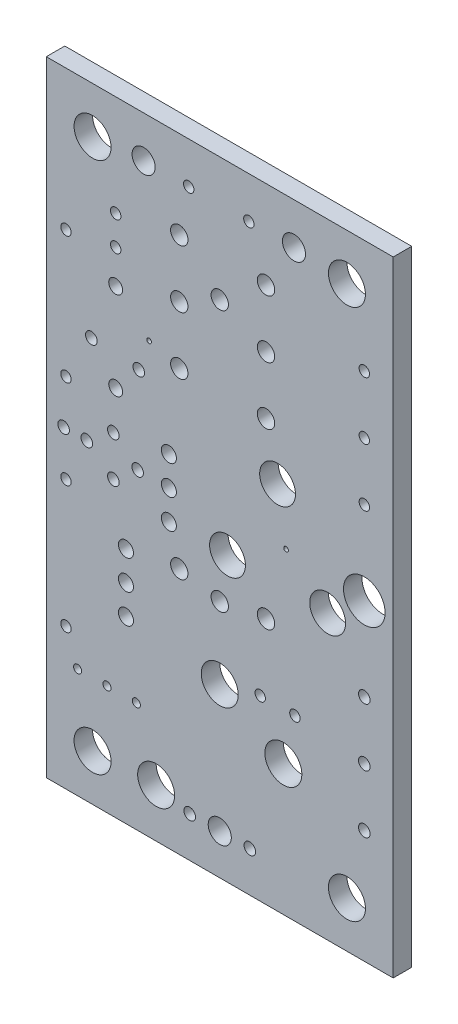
from build123d import *

# Parameters (mm, degrees)
MODEL_W            = 30
MODEL_H            = 54
MODEL_R            = 0.5
MODEL_R_2          = 0.65
MODEL_R_3          = 0.45
MODEL_R_4          = 0.75
MODEL_R_5          = 1.8
MODEL_R_6          = 0.6
MODEL_R_7          = 1.55
MODEL_R_8          = 0.35
MODEL_R_9          = 1
MODEL_R_10         = 1.6
MODEL_R_11         = 0.2
BOSS_EXTRU_1_DEPTH = 1.6


with BuildPart() as part:
    # Model → Boss.-Extru.1 (new body)
    with BuildSketch(Plane.XY):
        with Locations((15, 27)):
            Rectangle(MODEL_W, MODEL_H)
        with Locations((5.79882, 28.75026)):
            Circle(MODEL_R, mode=Mode.SUBTRACT)
        with Locations((6.88975, 18.04924)):
            Circle(MODEL_R_2, mode=Mode.SUBTRACT)
        with Locations((10.60069, 27.0002)):
            Circle(MODEL_R_2, mode=Mode.SUBTRACT)
        with Locations((1.70053, 30.8991)):
            Circle(MODEL_R_3, mode=Mode.SUBTRACT)
        with Locations((19.00047, 41.40074)):
            Circle(MODEL_R_4, mode=Mode.SUBTRACT)
        with Locations((5.79882, 25.25026)):
            Circle(MODEL_R, mode=Mode.SUBTRACT)
        with Locations((7.89882, 27.00026)):
            Circle(MODEL_R, mode=Mode.SUBTRACT)
        with Locations((3.49882, 27.00026)):
            Circle(MODEL_R, mode=Mode.SUBTRACT)
        with Locations((1.49882, 27.00026)):
            Circle(MODEL_R, mode=Mode.SUBTRACT)
        with Locations((10.60069, 29.5402)):
            Circle(MODEL_R_2, mode=Mode.SUBTRACT)
        with Locations((14.99997, 20.69973)):
            Circle(MODEL_R_4, mode=Mode.SUBTRACT)
        with Locations((14.99997, 43.29973)):
            Circle(MODEL_R_4, mode=Mode.SUBTRACT)
        with Locations((19.00047, 46.40074)):
            Circle(MODEL_R_4, mode=Mode.SUBTRACT)
        with Locations((11.50047, 36.40074)):
            Circle(MODEL_R_4, mode=Mode.SUBTRACT)
        with Locations((11.50047, 41.40074)):
            Circle(MODEL_R_4, mode=Mode.SUBTRACT)
        with Locations((11.50047, 46.40074)):
            Circle(MODEL_R_4, mode=Mode.SUBTRACT)
        with Locations((27.49931, 39.20108)):
            Circle(MODEL_R_3, mode=Mode.SUBTRACT)
        with Locations((27.49931, 34.20108)):
            Circle(MODEL_R_3, mode=Mode.SUBTRACT)
        with Locations((27.50058, 27.00058)):
            Circle(MODEL_R_5, mode=Mode.SUBTRACT)
        with Locations((5.99948, 39.80942)):
            Circle(MODEL_R_6, mode=Mode.SUBTRACT)
        with Locations((24.33058, 24.50058)):
            Circle(MODEL_R_7, mode=Mode.SUBTRACT)
        with Locations((27.50058, 19.80058)):
            Circle(MODEL_R, mode=Mode.SUBTRACT)
        with Locations((7.78891, 9.4996)):
            Circle(MODEL_R_8, mode=Mode.SUBTRACT)
        with Locations((2.70891, 9.4996)):
            Circle(MODEL_R_8, mode=Mode.SUBTRACT)
        with Locations((15.67058, 24.50058)):
            Circle(MODEL_R_7, mode=Mode.SUBTRACT)
        with Locations((27.50058, 9.79932)):
            Circle(MODEL_R, mode=Mode.SUBTRACT)
        with Locations((6.88975, 15.50924)):
            Circle(MODEL_R_2, mode=Mode.SUBTRACT)
        with Locations((20.00058, 32.00058)):
            Circle(MODEL_R_7, mode=Mode.SUBTRACT)
        with Locations((12.31711, 50.41646)):
            Circle(MODEL_R_3, mode=Mode.SUBTRACT)
        with Locations((21.41711, 50.41646)):
            Circle(MODEL_R_9, mode=Mode.SUBTRACT)
        with Locations((8.41711, 50.41646)):
            Circle(MODEL_R_9, mode=Mode.SUBTRACT)
        with Locations((1.70053, 12.19962)):
            Circle(MODEL_R_3, mode=Mode.SUBTRACT)
        with Locations((20.49907, 11.303)):
            Circle(MODEL_R_10, mode=Mode.SUBTRACT)
        with Locations((14.9987, 14.50213)):
            Circle(MODEL_R_10, mode=Mode.SUBTRACT)
        with Locations((9.4996, 4.20243)):
            Circle(MODEL_R_10, mode=Mode.SUBTRACT)
        with Locations((6.88975, 20.58924)):
            Circle(MODEL_R_2, mode=Mode.SUBTRACT)
        with Locations((10.60069, 24.4602)):
            Circle(MODEL_R_2, mode=Mode.SUBTRACT)
        with Locations((1.70053, 23.20036)):
            Circle(MODEL_R_3, mode=Mode.SUBTRACT)
        with Locations((27.50058, 14.80058)):
            Circle(MODEL_R, mode=Mode.SUBTRACT)
        with Locations((20.73656, 27.4828)):
            Circle(MODEL_R_11, mode=Mode.SUBTRACT)
        with Locations((8.89508, 37.16528)):
            Circle(MODEL_R_11, mode=Mode.SUBTRACT)
        with Locations((6.00329, 45.26788)):
            Circle(MODEL_R_3, mode=Mode.SUBTRACT)
        with Locations((1.70053, 41.89984)):
            Circle(MODEL_R_3, mode=Mode.SUBTRACT)
        with Locations((19.00047, 36.40074)):
            Circle(MODEL_R_4, mode=Mode.SUBTRACT)
        with Locations((27.49931, 44.20108)):
            Circle(MODEL_R_3, mode=Mode.SUBTRACT)
        with Locations((5.99948, 32.18942)):
            Circle(MODEL_R_6, mode=Mode.SUBTRACT)
        with Locations((19.00047, 21.3995)):
            Circle(MODEL_R_4, mode=Mode.SUBTRACT)
        with Locations((5.24891, 9.4996)):
            Circle(MODEL_R_8, mode=Mode.SUBTRACT)
        with Locations((21.49983, 15.40002)):
            Circle(MODEL_R_3, mode=Mode.SUBTRACT)
        with Locations((6.00329, 42.72788)):
            Circle(MODEL_R_3, mode=Mode.SUBTRACT)
        with Locations((17.51711, 50.41646)):
            Circle(MODEL_R_3, mode=Mode.SUBTRACT)
        with Locations((3.89763, 34.88182)):
            Circle(MODEL_R, mode=Mode.SUBTRACT)
        with Locations((7.99592, 34.55416)):
            Circle(MODEL_R, mode=Mode.SUBTRACT)
        with Locations((18.50009, 15.40002)):
            Circle(MODEL_R_3, mode=Mode.SUBTRACT)
        with Locations((11.49985, 21.3995)):
            Circle(MODEL_R_4, mode=Mode.SUBTRACT)
        with Locations((4, 50)):
            Circle(MODEL_R_10, mode=Mode.SUBTRACT)
        with Locations(Location((26, 50, 0), (0, 0, 180))):
            Circle(MODEL_R_10, mode=Mode.SUBTRACT)
        with Locations((26, 4)):
            Circle(MODEL_R_10, mode=Mode.SUBTRACT)
        with Locations(Location((4, 4, 0), (0, 0, 180))):
            Circle(MODEL_R_10, mode=Mode.SUBTRACT)
        with Locations((12.40028, 3.50012)):
            Circle(MODEL_R, mode=Mode.SUBTRACT)
        with Locations((15.00028, 3.50012)):
            Circle(MODEL_R_9, mode=Mode.SUBTRACT)
        with Locations((17.60028, 3.50012)):
            Circle(MODEL_R, mode=Mode.SUBTRACT)
    extrude(amount=BOSS_EXTRU_1_DEPTH)


solid = part.part
